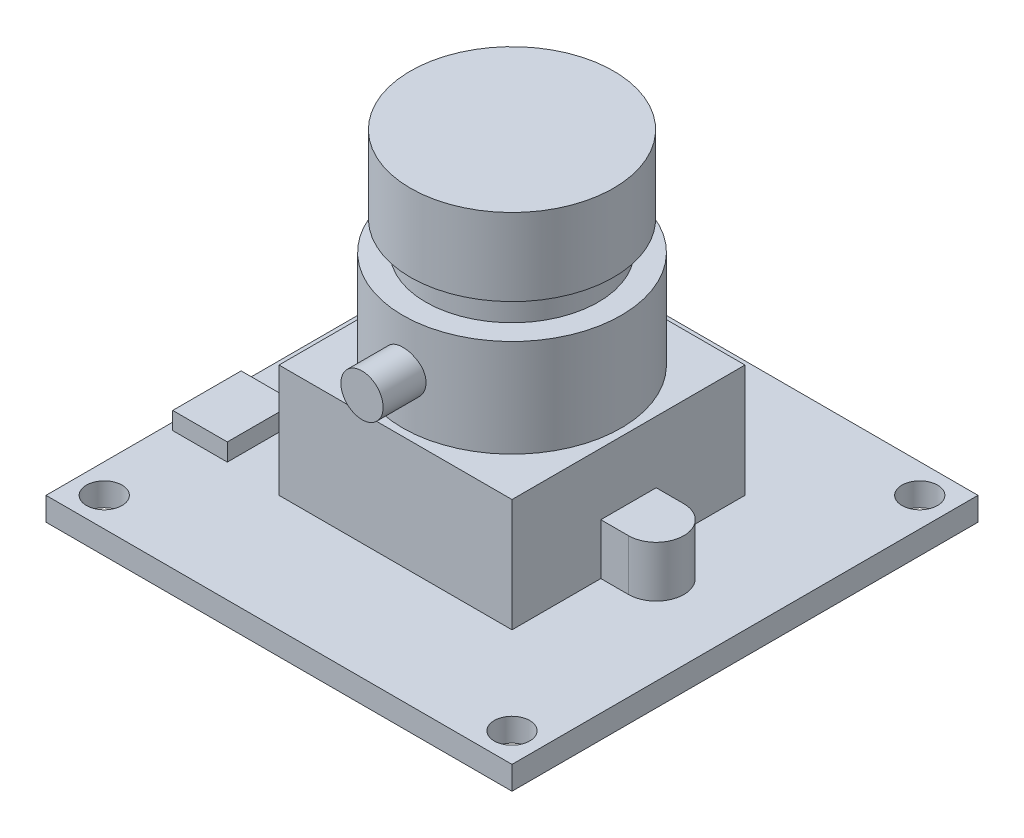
from build123d import *

# Parameters (mm, degrees)
SKETCH1_W                = 32
SKETCH1_H                = 32
SKETCH1_R                = 1.22
BOSS_EXTRUDE1_DEPTH      = 1.6
SKETCH2_W                = 16
SKETCH2_H                = 16
BOSS_EXTRUDE2_DEPTH      = 7.75
SKETCH3_R                = 7.5
BOSS_EXTRUDE3_DEPTH      = 6.7
SKETCH4_R                = 5.925
BOSS_EXTRUDE4_DEPTH      = 2
SKETCH5_R                = 6.975
BOSS_EXTRUDE5_DEPTH      = 5.3
BOSS_EXTRUDE6_DEPTH      = 2.8
BOSS_EXTRUDE6_DEPTH_BACK = 2.8
SKETCH6_R                = 1.45
BOSS_EXTRUDE7_DEPTH      = 3.5
SKETCH8_W                = 3.75
SKETCH8_H                = 4.7
BOSS_EXTRUDE8_DEPTH      = 1.2
SKETCH9_W                = 10
SKETCH9_H                = 4.7
BOSS_EXTRUDE9_DEPTH      = 6


with BuildPart() as part:
    # Sketch1 → Boss-Extrude1 (new body)
    with BuildSketch(Plane(origin=(0, 0, 0), x_dir=(1, 0, 0), z_dir=(0, 1, 0))):
        with Locations((16, 16)):
            Rectangle(SKETCH1_W, SKETCH1_H)
        with Locations(Location((2, 30, 0), (0, 0, 270))):
            Circle(SKETCH1_R, mode=Mode.SUBTRACT)
        with Locations(Location((2, 2, 0), (0, 0, 270))):
            Circle(SKETCH1_R, mode=Mode.SUBTRACT)
        with Locations(Location((30, 2, 0), (0, 0, 270))):
            Circle(SKETCH1_R, mode=Mode.SUBTRACT)
        with Locations(Location((30, 30, 0), (0, 0, 270))):
            Circle(SKETCH1_R, mode=Mode.SUBTRACT)
    extrude(amount=BOSS_EXTRUDE1_DEPTH)

    # Sketch2 → Boss-Extrude2 (add)
    with BuildSketch(Plane(origin=(0, 1.6, 0), x_dir=(1, 0, 0), z_dir=(0, 1, 0))):
        with Locations((16, 16)):
            Rectangle(SKETCH2_W, SKETCH2_H)
    extrude(amount=BOSS_EXTRUDE2_DEPTH)

    # Sketch3 → Boss-Extrude3 (add)
    with BuildSketch(Plane(origin=(0, 9.35, 0), x_dir=(1, 0, 0), z_dir=(0, 1, 0))):
        with Locations(Location((16, 16, 0), (0, 0, 270))):
            Circle(SKETCH3_R)
    extrude(amount=BOSS_EXTRUDE3_DEPTH)

    # Sketch4 → Boss-Extrude4 (add)
    with BuildSketch(Plane(origin=(0, 16.05, 0), x_dir=(1, 0, 0), z_dir=(0, 1, 0))):
        with Locations(Location((16, 16, 0), (0, 0, 270))):
            Circle(SKETCH4_R)
    extrude(amount=BOSS_EXTRUDE4_DEPTH)

    # Sketch5 → Boss-Extrude5 (add)
    with BuildSketch(Plane(origin=(0, 18.05, 0), x_dir=(-1, 0, 0), z_dir=(0, 1, 0))):
        with Locations(Location((-16, -16, 0), (0, 0, 90))):
            Circle(SKETCH5_R)
    extrude(amount=BOSS_EXTRUDE5_DEPTH)

    # Sketch7 → Boss-Extrude7 (add)
    with BuildSketch(Plane(origin=(0, 1.6, 0), x_dir=(1, 0, 0), z_dir=(0, 1, 0))):
        with BuildLine():
            Line((6.1, 17.9), (8, 17.9))
            Line((8, 17.9), (8, 14.1))
            Line((8, 14.1), (6.1, 14.1))
            ThreePointArc((6.1, 14.1), (4.2, 16), (6.1, 17.9))
        make_face()
        with BuildLine():
            Line((25.9, 17.9), (24, 17.9))
            Line((24, 17.9), (24, 14.1))
            Line((24, 14.1), (25.9, 14.1))
            ThreePointArc((25.9, 14.1), (27.8, 16), (25.9, 17.9))
        make_face()
    extrude(amount=BOSS_EXTRUDE7_DEPTH)

    # Sketch8 → Boss-Extrude8 (add)
    with BuildSketch(Plane(origin=(0, 1.6, 0), x_dir=(1, 0, 0), z_dir=(0, 1, 0))):
        with Locations((2.375, 10.55)):
            Rectangle(SKETCH8_W, SKETCH8_H)
    extrude(amount=BOSS_EXTRUDE8_DEPTH)

    # Sketch9 → Boss-Extrude9 (add)
    with BuildSketch(Plane(origin=(0, 0, 0), x_dir=(-1, 0, 0), z_dir=(0, -1, 0))):
        with Locations((-10.9, 29.4)):
            Rectangle(SKETCH9_W, SKETCH9_H)
    extrude(amount=BOSS_EXTRUDE9_DEPTH)


with BuildPart() as body_2:
    # Sketch6 → Boss-Extrude6 (new, two sides: drawn at the far end of the back side and taken through both)
    with BuildSketch(Plane.XY.offset(-8.5).offset(-BOSS_EXTRUDE6_DEPTH_BACK)):
        with Locations((16, 12.7)):
            Circle(SKETCH6_R)
    extrude(amount=BOSS_EXTRUDE6_DEPTH + BOSS_EXTRUDE6_DEPTH_BACK)


solid = Compound([part.part, body_2.part])
